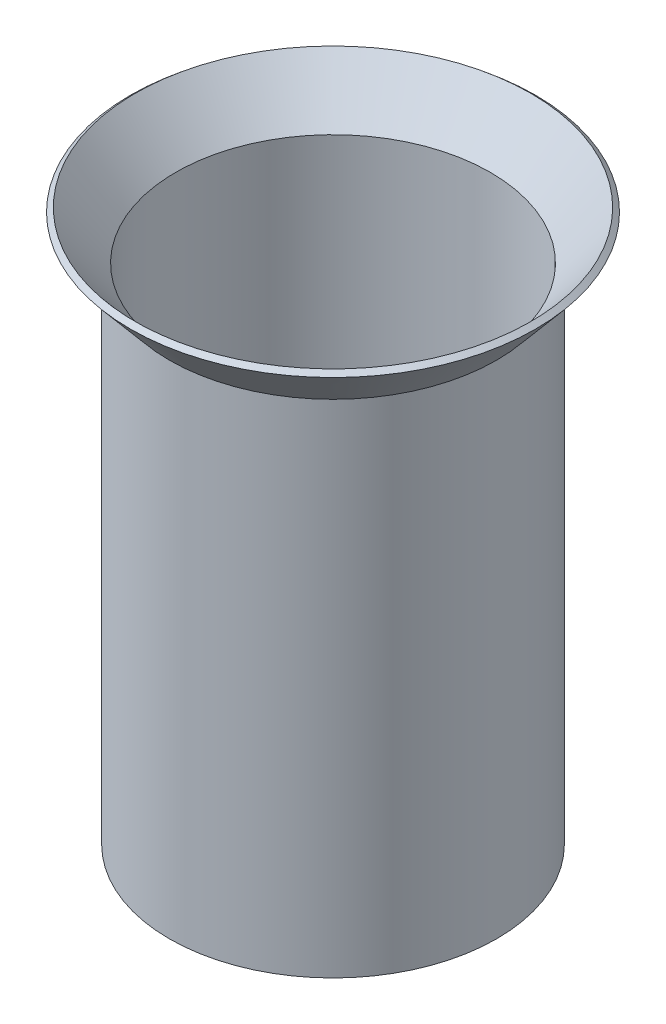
ISO-10303-21;
HEADER;
FILE_DESCRIPTION(('STEP AP214'),'2;1');
FILE_NAME('part.step','',(''),(''),'','','');
FILE_SCHEMA(('AUTOMOTIVE_DESIGN { 1 0 10303 214 1 1 1 1 }'));
ENDSEC;
DATA;
#1=APPLICATION_CONTEXT('core data for automotive mechanical design processes');
#2=APPLICATION_PROTOCOL_DEFINITION('international standard','automotive_design',2000,#1);
#3=PRODUCT_CONTEXT('',#1,'mechanical');
#4=PRODUCT('Part','Part','',(#3));
#5=PRODUCT_RELATED_PRODUCT_CATEGORY('part','',(#4));
#6=PRODUCT_DEFINITION_FORMATION('','',#4);
#7=PRODUCT_DEFINITION_CONTEXT('part definition',#1,'design');
#8=PRODUCT_DEFINITION('design','',#6,#7);
#9=PRODUCT_DEFINITION_SHAPE('','',#8);
#10=(LENGTH_UNIT() NAMED_UNIT(*) SI_UNIT(.MILLI.,.METRE.));
#11=(NAMED_UNIT(*) PLANE_ANGLE_UNIT() SI_UNIT($,.RADIAN.));
#12=(NAMED_UNIT(*) SI_UNIT($,.STERADIAN.) SOLID_ANGLE_UNIT());
#13=UNCERTAINTY_MEASURE_WITH_UNIT(LENGTH_MEASURE(1.E-05),#10,'distance_accuracy_value','');
#14=(GEOMETRIC_REPRESENTATION_CONTEXT(3) GLOBAL_UNCERTAINTY_ASSIGNED_CONTEXT((#13)) GLOBAL_UNIT_ASSIGNED_CONTEXT((#10,
#11,#12)) REPRESENTATION_CONTEXT('',''));
#15=CARTESIAN_POINT('',(0.,0.,0.));
#16=DIRECTION('',(0.,0.,1.));
#17=DIRECTION('',(1.,0.,0.));
#18=AXIS2_PLACEMENT_3D('',#15,#16,#17);
#19=CARTESIAN_POINT('',(0.,79.6360297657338,0.));
#20=DIRECTION('',(0.,1.,0.));
#21=DIRECTION('',(0.,0.,1.));
#22=AXIS2_PLACEMENT_3D('',#19,#20,#21);
#23=CONICAL_SURFACE('',#22,26.,0.698131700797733);
#24=CARTESIAN_POINT('',(0.,87.0176568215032,0.));
#25=DIRECTION('',(0.,-1.,0.));
#26=DIRECTION('',(0.,0.,-1.));
#27=AXIS2_PLACEMENT_3D('',#24,#25,#26);
#28=CIRCLE('',#27,32.1939205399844);
#29=CARTESIAN_POINT('',(0.,87.0176568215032,-32.1939205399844));
#30=VERTEX_POINT('',#29);
#31=EDGE_CURVE('E53',#30,#30,#28,.T.);
#32=ORIENTED_EDGE('',*,*,#31,.T.);
#33=EDGE_LOOP('',(#32));
#34=FACE_BOUND('',#33,.T.);
#35=CARTESIAN_POINT('',(0.,79.6360297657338,0.));
#36=DIRECTION('',(0.,-1.,0.));
#37=DIRECTION('',(0.,0.,-1.));
#38=AXIS2_PLACEMENT_3D('',#35,#36,#37);
#39=CIRCLE('',#38,26.);
#40=CARTESIAN_POINT('',(0.,79.6360297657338,-26.));
#41=VERTEX_POINT('',#40);
#42=EDGE_CURVE('E10',#41,#41,#39,.T.);
#43=ORIENTED_EDGE('',*,*,#42,.F.);
#44=EDGE_LOOP('',(#43));
#45=FACE_BOUND('',#44,.T.);
#46=ADVANCED_FACE('F31',(#34,#45),#23,.T.);
#47=CARTESIAN_POINT('',(0.,0.,0.));
#48=DIRECTION('',(0.,-1.,0.));
#49=DIRECTION('',(0.,0.,-1.));
#50=AXIS2_PLACEMENT_3D('',#47,#48,#49);
#51=CYLINDRICAL_SURFACE('',#50,26.);
#52=ORIENTED_EDGE('',*,*,#42,.T.);
#53=EDGE_LOOP('',(#52));
#54=FACE_BOUND('',#53,.T.);
#55=CARTESIAN_POINT('',(0.,0.,0.));
#56=DIRECTION('',(0.,-1.,0.));
#57=DIRECTION('',(0.,0.,-1.));
#58=AXIS2_PLACEMENT_3D('',#55,#56,#57);
#59=CIRCLE('',#58,26.);
#60=CARTESIAN_POINT('',(0.,0.,-26.));
#61=VERTEX_POINT('',#60);
#62=EDGE_CURVE('E37',#61,#61,#59,.T.);
#63=ORIENTED_EDGE('',*,*,#62,.F.);
#64=EDGE_LOOP('',(#63));
#65=FACE_BOUND('',#64,.T.);
#66=ADVANCED_FACE('F79',(#54,#65),#51,.T.);
#67=CARTESIAN_POINT('',(26.,0.,0.));
#68=DIRECTION('',(0.,1.,0.));
#69=DIRECTION('',(0.,0.,1.));
#70=AXIS2_PLACEMENT_3D('',#67,#68,#69);
#71=PLANE('',#70);
#72=CARTESIAN_POINT('',(0.,0.,0.));
#73=DIRECTION('',(0.,-1.,0.));
#74=DIRECTION('',(0.,0.,-1.));
#75=AXIS2_PLACEMENT_3D('',#72,#73,#74);
#76=CIRCLE('',#75,25.);
#77=CARTESIAN_POINT('',(0.,0.,-25.));
#78=VERTEX_POINT('',#77);
#79=EDGE_CURVE('E41',#78,#78,#76,.T.);
#80=ORIENTED_EDGE('',*,*,#79,.F.);
#81=EDGE_LOOP('',(#80));
#82=FACE_BOUND('',#81,.T.);
#83=ORIENTED_EDGE('',*,*,#62,.T.);
#84=EDGE_LOOP('',(#83));
#85=FACE_BOUND('',#84,.T.);
#86=ADVANCED_FACE('F74',(#82,#85),#71,.F.);
#87=CARTESIAN_POINT('',(0.,0.,0.));
#88=DIRECTION('',(0.,-1.,0.));
#89=DIRECTION('',(0.,0.,-1.));
#90=AXIS2_PLACEMENT_3D('',#87,#88,#89);
#91=CYLINDRICAL_SURFACE('',#90,25.);
#92=CARTESIAN_POINT('',(0.,80.,0.));
#93=DIRECTION('',(0.,-1.,0.));
#94=DIRECTION('',(0.,0.,-1.));
#95=AXIS2_PLACEMENT_3D('',#92,#93,#94);
#96=CIRCLE('',#95,25.);
#97=CARTESIAN_POINT('',(0.,80.,-25.));
#98=VERTEX_POINT('',#97);
#99=EDGE_CURVE('E45',#98,#98,#96,.T.);
#100=ORIENTED_EDGE('',*,*,#99,.F.);
#101=EDGE_LOOP('',(#100));
#102=FACE_BOUND('',#101,.T.);
#103=ORIENTED_EDGE('',*,*,#79,.T.);
#104=EDGE_LOOP('',(#103));
#105=FACE_BOUND('',#104,.T.);
#106=ADVANCED_FACE('F68',(#102,#105),#91,.F.);
#107=CARTESIAN_POINT('',(0.,80.,0.));
#108=DIRECTION('',(0.,1.,0.));
#109=DIRECTION('',(0.,0.,1.));
#110=AXIS2_PLACEMENT_3D('',#107,#108,#109);
#111=CONICAL_SURFACE('',#110,25.,0.698131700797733);
#112=CARTESIAN_POINT('',(0.,87.6604444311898,0.));
#113=DIRECTION('',(0.,-1.,0.));
#114=DIRECTION('',(0.,0.,-1.));
#115=AXIS2_PLACEMENT_3D('',#112,#113,#114);
#116=CIRCLE('',#115,31.4278760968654);
#117=CARTESIAN_POINT('',(0.,87.6604444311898,-31.4278760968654));
#118=VERTEX_POINT('',#117);
#119=EDGE_CURVE('E50',#118,#118,#116,.T.);
#120=ORIENTED_EDGE('',*,*,#119,.F.);
#121=EDGE_LOOP('',(#120));
#122=FACE_BOUND('',#121,.T.);
#123=ORIENTED_EDGE('',*,*,#99,.T.);
#124=EDGE_LOOP('',(#123));
#125=FACE_BOUND('',#124,.T.);
#126=ADVANCED_FACE('F62',(#122,#125),#111,.F.);
#127=CARTESIAN_POINT('',(0.,87.6604444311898,0.));
#128=DIRECTION('',(0.,-1.,0.));
#129=DIRECTION('',(0.,0.,-1.));
#130=AXIS2_PLACEMENT_3D('',#127,#128,#129);
#131=CONICAL_SURFACE('',#130,31.4278760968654,0.872664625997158);
#132=ORIENTED_EDGE('',*,*,#31,.F.);
#133=EDGE_LOOP('',(#132));
#134=FACE_BOUND('',#133,.T.);
#135=ORIENTED_EDGE('',*,*,#119,.T.);
#136=EDGE_LOOP('',(#135));
#137=FACE_BOUND('',#136,.T.);
#138=ADVANCED_FACE('F59',(#134,#137),#131,.T.);
#139=CLOSED_SHELL('',(#46,#66,#86,#106,#126,#138));
#140=MANIFOLD_SOLID_BREP('B2',#139);
#141=ADVANCED_BREP_SHAPE_REPRESENTATION('',(#18,#140),#14);
#142=SHAPE_DEFINITION_REPRESENTATION(#9,#141);
ENDSEC;
END-ISO-10303-21;
